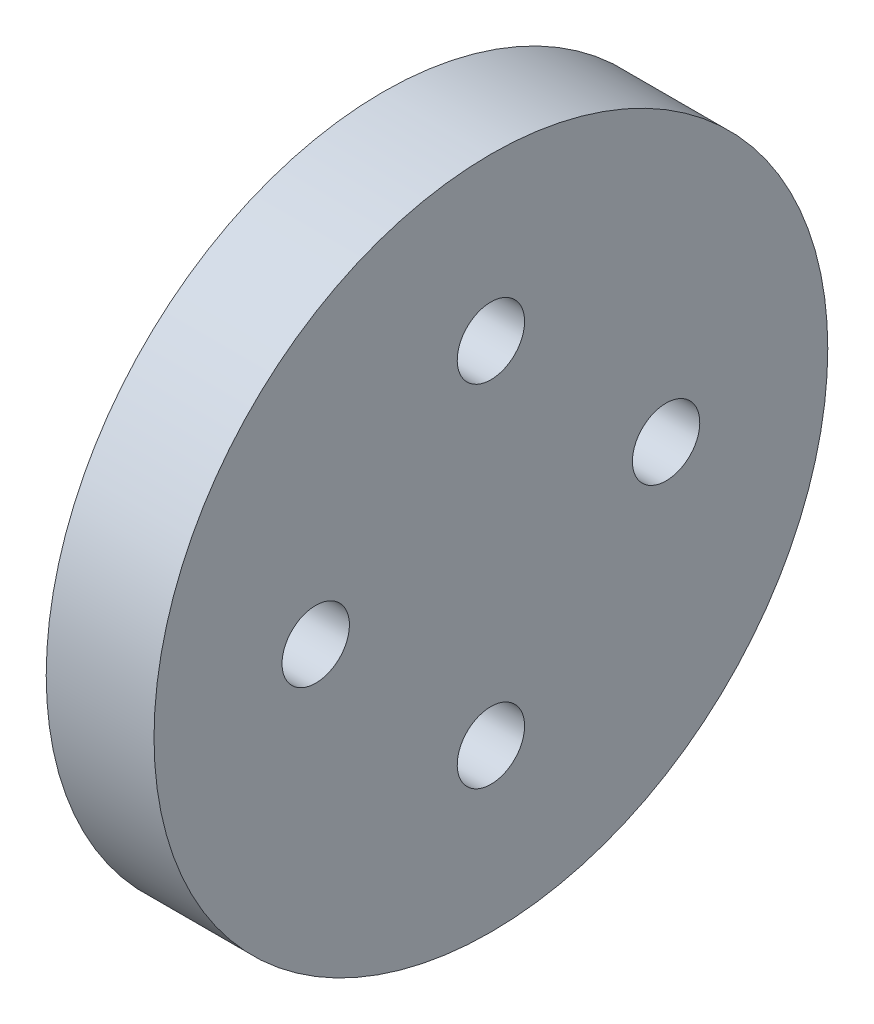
ISO-10303-21;
HEADER;
FILE_DESCRIPTION(('STEP AP214'),'2;1');
FILE_NAME('part.step','',(''),(''),'','','');
FILE_SCHEMA(('AUTOMOTIVE_DESIGN { 1 0 10303 214 1 1 1 1 }'));
ENDSEC;
DATA;
#1=APPLICATION_CONTEXT('core data for automotive mechanical design processes');
#2=APPLICATION_PROTOCOL_DEFINITION('international standard','automotive_design',2000,#1);
#3=PRODUCT_CONTEXT('',#1,'mechanical');
#4=PRODUCT('Part','Part','',(#3));
#5=PRODUCT_RELATED_PRODUCT_CATEGORY('part','',(#4));
#6=PRODUCT_DEFINITION_FORMATION('','',#4);
#7=PRODUCT_DEFINITION_CONTEXT('part definition',#1,'design');
#8=PRODUCT_DEFINITION('design','',#6,#7);
#9=PRODUCT_DEFINITION_SHAPE('','',#8);
#10=(LENGTH_UNIT() NAMED_UNIT(*) SI_UNIT(.MILLI.,.METRE.));
#11=(NAMED_UNIT(*) PLANE_ANGLE_UNIT() SI_UNIT($,.RADIAN.));
#12=(NAMED_UNIT(*) SI_UNIT($,.STERADIAN.) SOLID_ANGLE_UNIT());
#13=UNCERTAINTY_MEASURE_WITH_UNIT(LENGTH_MEASURE(1.E-05),#10,'distance_accuracy_value','');
#14=(GEOMETRIC_REPRESENTATION_CONTEXT(3) GLOBAL_UNCERTAINTY_ASSIGNED_CONTEXT((#13)) GLOBAL_UNIT_ASSIGNED_CONTEXT((#10,
#11,#12)) REPRESENTATION_CONTEXT('',''));
#15=CARTESIAN_POINT('',(0.,0.,0.));
#16=DIRECTION('',(0.,0.,1.));
#17=DIRECTION('',(1.,0.,0.));
#18=AXIS2_PLACEMENT_3D('',#15,#16,#17);
#19=CARTESIAN_POINT('',(0.,0.,0.));
#20=DIRECTION('',(1.,0.,0.));
#21=DIRECTION('',(0.,1.,0.));
#22=AXIS2_PLACEMENT_3D('',#19,#20,#21);
#23=PLANE('',#22);
#24=CARTESIAN_POINT('',(0.,6.5,0.));
#25=DIRECTION('',(1.,0.,0.));
#26=DIRECTION('',(0.,1.,0.));
#27=AXIS2_PLACEMENT_3D('',#24,#25,#26);
#28=CIRCLE('',#27,1.25);
#29=CARTESIAN_POINT('',(0.,7.75,0.));
#30=VERTEX_POINT('',#29);
#31=EDGE_CURVE('E72',#30,#30,#28,.T.);
#32=ORIENTED_EDGE('',*,*,#31,.F.);
#33=EDGE_LOOP('',(#32));
#34=FACE_BOUND('',#33,.T.);
#35=CARTESIAN_POINT('',(0.,-6.5,0.));
#36=DIRECTION('',(1.,0.,0.));
#37=DIRECTION('',(0.,1.,0.));
#38=AXIS2_PLACEMENT_3D('',#35,#36,#37);
#39=CIRCLE('',#38,1.25);
#40=CARTESIAN_POINT('',(0.,-5.25,0.));
#41=VERTEX_POINT('',#40);
#42=EDGE_CURVE('E62',#41,#41,#39,.T.);
#43=ORIENTED_EDGE('',*,*,#42,.F.);
#44=EDGE_LOOP('',(#43));
#45=FACE_BOUND('',#44,.T.);
#46=CARTESIAN_POINT('',(0.,0.,-6.5));
#47=DIRECTION('',(1.,0.,0.));
#48=DIRECTION('',(0.,1.,0.));
#49=AXIS2_PLACEMENT_3D('',#46,#47,#48);
#50=CIRCLE('',#49,1.25);
#51=CARTESIAN_POINT('',(0.,1.25,-6.5));
#52=VERTEX_POINT('',#51);
#53=EDGE_CURVE('E59',#52,#52,#50,.T.);
#54=ORIENTED_EDGE('',*,*,#53,.F.);
#55=EDGE_LOOP('',(#54));
#56=FACE_BOUND('',#55,.T.);
#57=CARTESIAN_POINT('',(0.,0.,6.5));
#58=DIRECTION('',(1.,0.,0.));
#59=DIRECTION('',(0.,1.,0.));
#60=AXIS2_PLACEMENT_3D('',#57,#58,#59);
#61=CIRCLE('',#60,1.25);
#62=CARTESIAN_POINT('',(0.,1.25,6.5));
#63=VERTEX_POINT('',#62);
#64=EDGE_CURVE('E56',#63,#63,#61,.T.);
#65=ORIENTED_EDGE('',*,*,#64,.F.);
#66=EDGE_LOOP('',(#65));
#67=FACE_BOUND('',#66,.T.);
#68=CARTESIAN_POINT('',(0.,0.,0.));
#69=DIRECTION('',(1.,0.,0.));
#70=DIRECTION('',(0.,1.,0.));
#71=AXIS2_PLACEMENT_3D('',#68,#69,#70);
#72=CIRCLE('',#71,12.5);
#73=CARTESIAN_POINT('',(0.,12.5,0.));
#74=VERTEX_POINT('',#73);
#75=EDGE_CURVE('E12',#74,#74,#72,.T.);
#76=ORIENTED_EDGE('',*,*,#75,.T.);
#77=EDGE_LOOP('',(#76));
#78=FACE_BOUND('',#77,.T.);
#79=ADVANCED_FACE('F36',(#34,#45,#56,#67,#78),#23,.T.);
#80=CARTESIAN_POINT('',(0.,0.,0.));
#81=DIRECTION('',(1.,0.,0.));
#82=DIRECTION('',(0.,1.,0.));
#83=AXIS2_PLACEMENT_3D('',#80,#81,#82);
#84=CYLINDRICAL_SURFACE('',#83,12.5);
#85=CARTESIAN_POINT('',(-4.,0.,0.));
#86=DIRECTION('',(1.,0.,0.));
#87=DIRECTION('',(0.,1.,0.));
#88=AXIS2_PLACEMENT_3D('',#85,#86,#87);
#89=CIRCLE('',#88,12.5);
#90=CARTESIAN_POINT('',(-4.,12.5,0.));
#91=VERTEX_POINT('',#90);
#92=EDGE_CURVE('E43',#91,#91,#89,.T.);
#93=ORIENTED_EDGE('',*,*,#92,.T.);
#94=EDGE_LOOP('',(#93));
#95=FACE_BOUND('',#94,.T.);
#96=ORIENTED_EDGE('',*,*,#75,.F.);
#97=EDGE_LOOP('',(#96));
#98=FACE_BOUND('',#97,.T.);
#99=ADVANCED_FACE('F100',(#95,#98),#84,.T.);
#100=CARTESIAN_POINT('',(-4.,12.5,0.));
#101=DIRECTION('',(-1.,0.,0.));
#102=DIRECTION('',(0.,-1.,0.));
#103=AXIS2_PLACEMENT_3D('',#100,#101,#102);
#104=PLANE('',#103);
#105=CARTESIAN_POINT('',(-4.,6.5,0.));
#106=DIRECTION('',(-1.,0.,0.));
#107=DIRECTION('',(0.,-1.,0.));
#108=AXIS2_PLACEMENT_3D('',#105,#106,#107);
#109=CIRCLE('',#108,1.25);
#110=CARTESIAN_POINT('',(-4.,5.25,0.));
#111=VERTEX_POINT('',#110);
#112=EDGE_CURVE('E39',#111,#111,#109,.T.);
#113=ORIENTED_EDGE('',*,*,#112,.F.);
#114=EDGE_LOOP('',(#113));
#115=FACE_BOUND('',#114,.T.);
#116=CARTESIAN_POINT('',(-4.,-6.5,0.));
#117=DIRECTION('',(-1.,0.,0.));
#118=DIRECTION('',(0.,-1.,0.));
#119=AXIS2_PLACEMENT_3D('',#116,#117,#118);
#120=CIRCLE('',#119,1.25);
#121=CARTESIAN_POINT('',(-4.,-7.75,0.));
#122=VERTEX_POINT('',#121);
#123=EDGE_CURVE('E60',#122,#122,#120,.T.);
#124=ORIENTED_EDGE('',*,*,#123,.F.);
#125=EDGE_LOOP('',(#124));
#126=FACE_BOUND('',#125,.T.);
#127=CARTESIAN_POINT('',(-4.,0.,-6.5));
#128=DIRECTION('',(-1.,0.,0.));
#129=DIRECTION('',(0.,-1.,0.));
#130=AXIS2_PLACEMENT_3D('',#127,#128,#129);
#131=CIRCLE('',#130,1.25);
#132=CARTESIAN_POINT('',(-4.,-1.25,-6.5));
#133=VERTEX_POINT('',#132);
#134=EDGE_CURVE('E57',#133,#133,#131,.T.);
#135=ORIENTED_EDGE('',*,*,#134,.F.);
#136=EDGE_LOOP('',(#135));
#137=FACE_BOUND('',#136,.T.);
#138=CARTESIAN_POINT('',(-4.,0.,6.5));
#139=DIRECTION('',(-1.,0.,0.));
#140=DIRECTION('',(0.,-1.,0.));
#141=AXIS2_PLACEMENT_3D('',#138,#139,#140);
#142=CIRCLE('',#141,1.25);
#143=CARTESIAN_POINT('',(-4.,-1.25,6.5));
#144=VERTEX_POINT('',#143);
#145=EDGE_CURVE('E52',#144,#144,#142,.T.);
#146=ORIENTED_EDGE('',*,*,#145,.F.);
#147=EDGE_LOOP('',(#146));
#148=FACE_BOUND('',#147,.T.);
#149=CARTESIAN_POINT('',(-4.,0.,0.));
#150=DIRECTION('',(1.,0.,0.));
#151=DIRECTION('',(0.,1.,0.));
#152=AXIS2_PLACEMENT_3D('',#149,#150,#151);
#153=CIRCLE('',#152,4.);
#154=CARTESIAN_POINT('',(-4.,4.,0.));
#155=VERTEX_POINT('',#154);
#156=EDGE_CURVE('E48',#155,#155,#153,.T.);
#157=ORIENTED_EDGE('',*,*,#156,.T.);
#158=EDGE_LOOP('',(#157));
#159=FACE_BOUND('',#158,.T.);
#160=ORIENTED_EDGE('',*,*,#92,.F.);
#161=EDGE_LOOP('',(#160));
#162=FACE_BOUND('',#161,.T.);
#163=ADVANCED_FACE('F84',(#115,#126,#137,#148,#159,#162),#104,.T.);
#164=CARTESIAN_POINT('',(0.,0.,0.));
#165=DIRECTION('',(1.,0.,0.));
#166=DIRECTION('',(0.,1.,0.));
#167=AXIS2_PLACEMENT_3D('',#164,#165,#166);
#168=CYLINDRICAL_SURFACE('',#167,4.);
#169=CARTESIAN_POINT('',(-8.,0.,0.));
#170=DIRECTION('',(1.,0.,0.));
#171=DIRECTION('',(0.,1.,0.));
#172=AXIS2_PLACEMENT_3D('',#169,#170,#171);
#173=CIRCLE('',#172,4.);
#174=CARTESIAN_POINT('',(-8.,4.,0.));
#175=VERTEX_POINT('',#174);
#176=EDGE_CURVE('E79',#175,#175,#173,.T.);
#177=ORIENTED_EDGE('',*,*,#176,.T.);
#178=EDGE_LOOP('',(#177));
#179=FACE_BOUND('',#178,.T.);
#180=ORIENTED_EDGE('',*,*,#156,.F.);
#181=EDGE_LOOP('',(#180));
#182=FACE_BOUND('',#181,.T.);
#183=ADVANCED_FACE('F87',(#179,#182),#168,.T.);
#184=CARTESIAN_POINT('',(-8.,0.,0.));
#185=DIRECTION('',(1.,0.,0.));
#186=DIRECTION('',(0.,1.,0.));
#187=AXIS2_PLACEMENT_3D('',#184,#185,#186);
#188=CONICAL_SURFACE('',#187,4.,0.78539816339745);
#189=CARTESIAN_POINT('',(-9.,0.,0.));
#190=DIRECTION('',(1.,0.,0.));
#191=DIRECTION('',(0.,1.,0.));
#192=AXIS2_PLACEMENT_3D('',#189,#190,#191);
#193=CIRCLE('',#192,3.);
#194=CARTESIAN_POINT('',(-9.,3.,0.));
#195=VERTEX_POINT('',#194);
#196=EDGE_CURVE('E55',#195,#195,#193,.T.);
#197=ORIENTED_EDGE('',*,*,#196,.T.);
#198=EDGE_LOOP('',(#197));
#199=FACE_BOUND('',#198,.T.);
#200=ORIENTED_EDGE('',*,*,#176,.F.);
#201=EDGE_LOOP('',(#200));
#202=FACE_BOUND('',#201,.T.);
#203=ADVANCED_FACE('F89',(#199,#202),#188,.T.);
#204=CARTESIAN_POINT('',(-9.,3.,0.));
#205=DIRECTION('',(-1.,0.,0.));
#206=DIRECTION('',(0.,-1.,0.));
#207=AXIS2_PLACEMENT_3D('',#204,#205,#206);
#208=PLANE('',#207);
#209=ORIENTED_EDGE('',*,*,#196,.F.);
#210=EDGE_LOOP('',(#209));
#211=FACE_BOUND('',#210,.T.);
#212=ADVANCED_FACE('F96',(#211),#208,.T.);
#213=CARTESIAN_POINT('',(-9.,0.,6.5));
#214=DIRECTION('',(1.,0.,0.));
#215=DIRECTION('',(0.,1.,0.));
#216=AXIS2_PLACEMENT_3D('',#213,#214,#215);
#217=CYLINDRICAL_SURFACE('',#216,1.25);
#218=ORIENTED_EDGE('',*,*,#145,.T.);
#219=EDGE_LOOP('',(#218));
#220=FACE_BOUND('',#219,.T.);
#221=ORIENTED_EDGE('',*,*,#64,.T.);
#222=EDGE_LOOP('',(#221));
#223=FACE_BOUND('',#222,.T.);
#224=ADVANCED_FACE('F117',(#220,#223),#217,.F.);
#225=CARTESIAN_POINT('',(-9.,0.,-6.5));
#226=DIRECTION('',(1.,0.,0.));
#227=DIRECTION('',(0.,1.,0.));
#228=AXIS2_PLACEMENT_3D('',#225,#226,#227);
#229=CYLINDRICAL_SURFACE('',#228,1.25);
#230=ORIENTED_EDGE('',*,*,#134,.T.);
#231=EDGE_LOOP('',(#230));
#232=FACE_BOUND('',#231,.T.);
#233=ORIENTED_EDGE('',*,*,#53,.T.);
#234=EDGE_LOOP('',(#233));
#235=FACE_BOUND('',#234,.T.);
#236=ADVANCED_FACE('F119',(#232,#235),#229,.F.);
#237=CARTESIAN_POINT('',(-9.,-6.5,0.));
#238=DIRECTION('',(1.,0.,0.));
#239=DIRECTION('',(0.,1.,0.));
#240=AXIS2_PLACEMENT_3D('',#237,#238,#239);
#241=CYLINDRICAL_SURFACE('',#240,1.25);
#242=ORIENTED_EDGE('',*,*,#123,.T.);
#243=EDGE_LOOP('',(#242));
#244=FACE_BOUND('',#243,.T.);
#245=ORIENTED_EDGE('',*,*,#42,.T.);
#246=EDGE_LOOP('',(#245));
#247=FACE_BOUND('',#246,.T.);
#248=ADVANCED_FACE('F125',(#244,#247),#241,.F.);
#249=CARTESIAN_POINT('',(-9.,6.5,0.));
#250=DIRECTION('',(1.,0.,0.));
#251=DIRECTION('',(0.,1.,0.));
#252=AXIS2_PLACEMENT_3D('',#249,#250,#251);
#253=CYLINDRICAL_SURFACE('',#252,1.25);
#254=ORIENTED_EDGE('',*,*,#112,.T.);
#255=EDGE_LOOP('',(#254));
#256=FACE_BOUND('',#255,.T.);
#257=ORIENTED_EDGE('',*,*,#31,.T.);
#258=EDGE_LOOP('',(#257));
#259=FACE_BOUND('',#258,.T.);
#260=ADVANCED_FACE('F133',(#256,#259),#253,.F.);
#261=CLOSED_SHELL('',(#79,#99,#163,#183,#203,#212,#224,#236,#248,#260));
#262=MANIFOLD_SOLID_BREP('B2',#261);
#263=ADVANCED_BREP_SHAPE_REPRESENTATION('',(#18,#262),#14);
#264=SHAPE_DEFINITION_REPRESENTATION(#9,#263);
ENDSEC;
END-ISO-10303-21;
